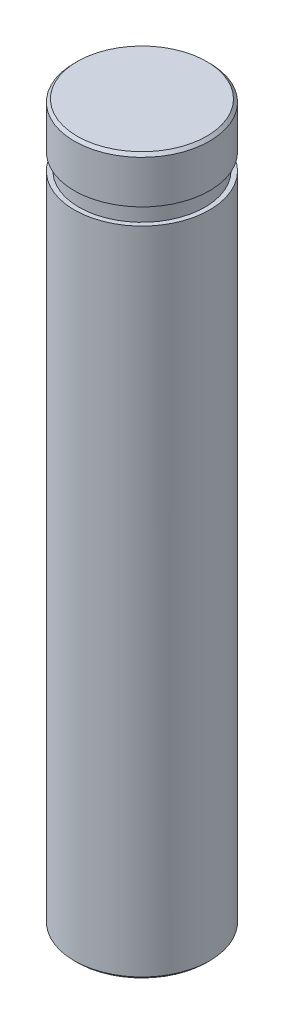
from build123d import *

# Parameters (mm, degrees)
CHAMFER1_SIZE = 0.127


with BuildPart() as part:
    # Sketch1 → Revolve1 (revolve)
    with BuildSketch(Plane.XY, mode=Mode.PRIVATE) as revolve1_sk:
        Polygon((0, 0), (-3, 0), (-3, 28.9814), (-2.794, 28.9814), (-2.794, 29.718), (-3, 29.718), (-3, 31.75), (0, 31.75), align=None)
    revolve(revolve1_sk.sketch.rotate(Axis((0, 0, 0), (0, -1, 0)), 270), axis=Axis((0, 0, 0), (0, -1, 0)))

    # Chamfer1
    chamfer1_edges = [part.edges().sort_by_distance(p)[0] for p in [
        (0, 31.75, -3),
        (0, 0, -3),
    ]]
    chamfer(chamfer1_edges, length=CHAMFER1_SIZE)


solid = part.part
